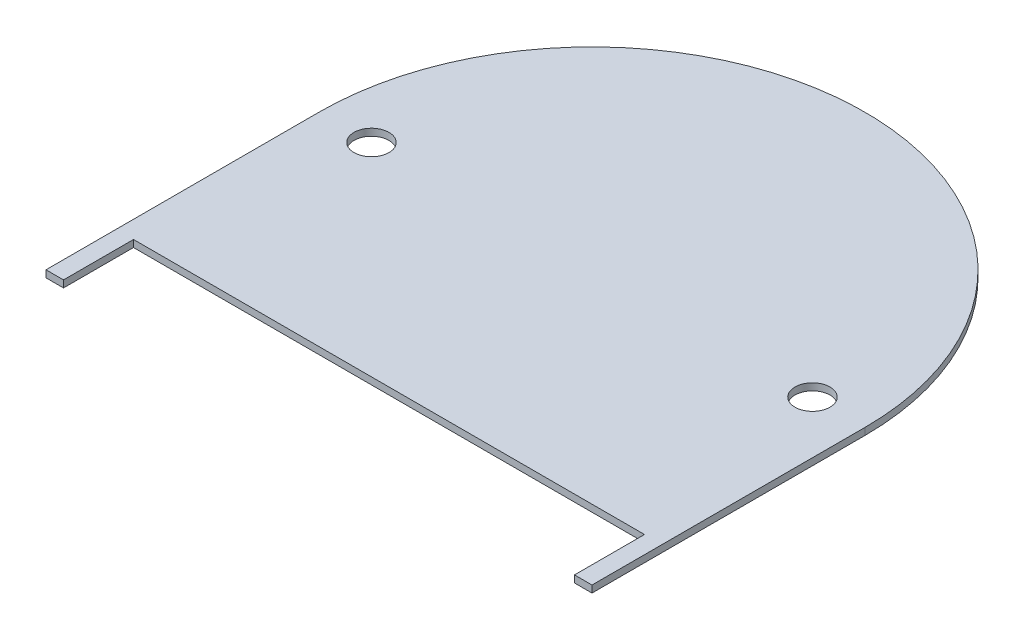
from build123d import *

# Parameters (mm, degrees)
BOSS_EXTRUDE1_DEPTH = 2.54
SKETCH2_R           = 6.35
SKETCH2_W           = 185.42
SKETCH2_H           = 25.4
CUT_EXTRUDE1_DEPTH  = 141.115019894


with BuildPart() as part:
    # Sketch1 → Boss-Extrude1 (new body)
    with BuildSketch(Plane(origin=(0, 0, 0), x_dir=(1, 0, 0), z_dir=(0, 1, 0))):
        with BuildLine():
            ThreePointArc((99.06, 0), (0, 99.06), (-99.06, 0))
            Line((-99.06, 0), (99.06, 0))
        make_face()
        with BuildLine():
            Line((99.06, 0), (-99.06, 0))
            ThreePointArc((-99.06, 0), (-70.045997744, -70.045997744), (0, -99.06))
            ThreePointArc((0, -99.06), (70.045997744, -70.045997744), (99.06, 0))
        make_face()
        with BuildLine():
            ThreePointArc((99.06, 0), (0, 99.06), (-99.06, 0))
            Line((-99.06, 0), (99.06, 0))
        make_face()
        with BuildLine():
            Line((99.06, 0), (-99.06, 0))
            ThreePointArc((-99.06, 0), (-70.045997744, -70.045997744), (0, -99.06))
            ThreePointArc((0, -99.06), (70.045997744, -70.045997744), (99.06, 0))
        make_face()
        with BuildLine():
            ThreePointArc((0, -99.06), (-70.045997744, -70.045997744), (-99.06, 0))
            Line((-99.06, 0), (-99.06, -99.06))
            Line((-99.06, -99.06), (0, -99.06))
        make_face()
        with BuildLine():
            Line((99.06, -99.06), (99.06, 0))
            ThreePointArc((99.06, 0), (70.045997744, -70.045997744), (0, -99.06))
            Line((0, -99.06), (99.06, -99.06))
        make_face()
    extrude(amount=BOSS_EXTRUDE1_DEPTH)

    # Sketch2 → Cut-Extrude1 (cut, through all)
    with BuildSketch(Plane(origin=(0, 2.54, 0), x_dir=(1, 0, 0), z_dir=(0, 1, 0))):
        with Locations(Location((-80.01, 0, 0), (0, 0, 270))):
            Circle(SKETCH2_R)
        with Locations(Location((80.01, 0, 0), (0, 0, 90))):
            Circle(SKETCH2_R)
        with Locations((0, -86.36)):
            Rectangle(SKETCH2_W, SKETCH2_H)
    extrude(amount=-CUT_EXTRUDE1_DEPTH, mode=Mode.SUBTRACT)


solid = part.part
